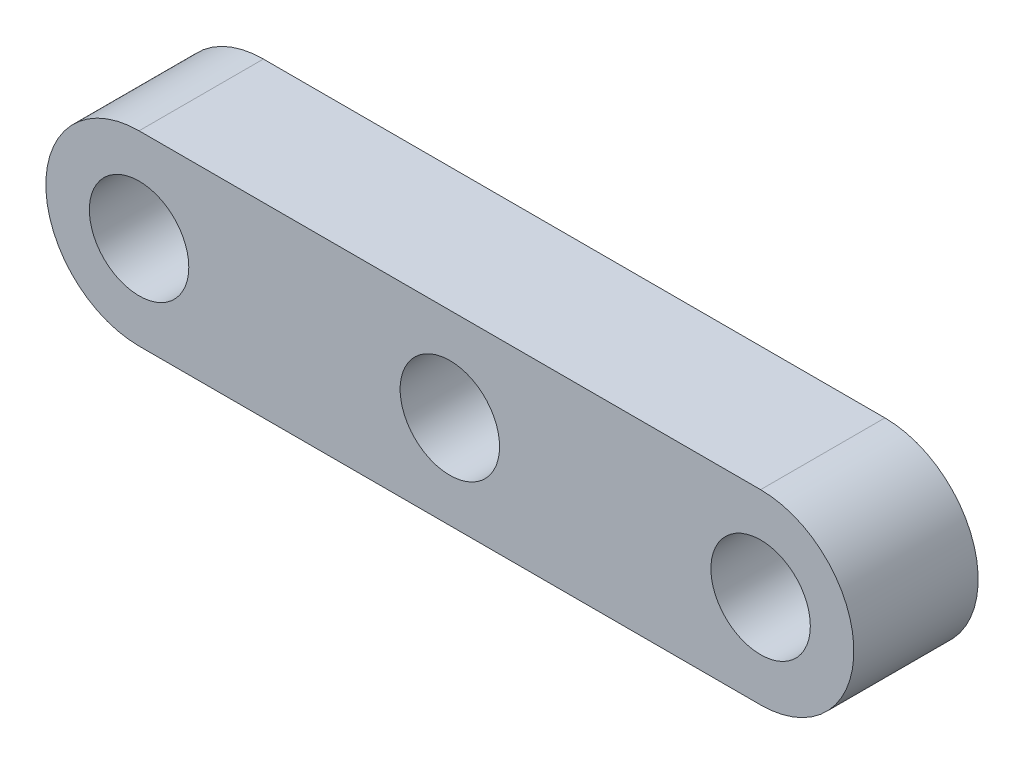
ISO-10303-21;
HEADER;
FILE_DESCRIPTION(('STEP AP214'),'2;1');
FILE_NAME('part.step','',(''),(''),'','','');
FILE_SCHEMA(('AUTOMOTIVE_DESIGN { 1 0 10303 214 1 1 1 1 }'));
ENDSEC;
DATA;
#1=APPLICATION_CONTEXT('core data for automotive mechanical design processes');
#2=APPLICATION_PROTOCOL_DEFINITION('international standard','automotive_design',2000,#1);
#3=PRODUCT_CONTEXT('',#1,'mechanical');
#4=PRODUCT('Part','Part','',(#3));
#5=PRODUCT_RELATED_PRODUCT_CATEGORY('part','',(#4));
#6=PRODUCT_DEFINITION_FORMATION('','',#4);
#7=PRODUCT_DEFINITION_CONTEXT('part definition',#1,'design');
#8=PRODUCT_DEFINITION('design','',#6,#7);
#9=PRODUCT_DEFINITION_SHAPE('','',#8);
#10=(LENGTH_UNIT() NAMED_UNIT(*) SI_UNIT(.MILLI.,.METRE.));
#11=(NAMED_UNIT(*) PLANE_ANGLE_UNIT() SI_UNIT($,.RADIAN.));
#12=(NAMED_UNIT(*) SI_UNIT($,.STERADIAN.) SOLID_ANGLE_UNIT());
#13=UNCERTAINTY_MEASURE_WITH_UNIT(LENGTH_MEASURE(1.E-05),#10,'distance_accuracy_value','');
#14=(GEOMETRIC_REPRESENTATION_CONTEXT(3) GLOBAL_UNCERTAINTY_ASSIGNED_CONTEXT((#13)) GLOBAL_UNIT_ASSIGNED_CONTEXT((#10,
#11,#12)) REPRESENTATION_CONTEXT('',''));
#15=CARTESIAN_POINT('',(0.,0.,0.));
#16=DIRECTION('',(0.,0.,1.));
#17=DIRECTION('',(1.,0.,0.));
#18=AXIS2_PLACEMENT_3D('',#15,#16,#17);
#19=CARTESIAN_POINT('',(0.,0.,2.));
#20=DIRECTION('',(0.,0.,1.));
#21=DIRECTION('',(1.,0.,0.));
#22=AXIS2_PLACEMENT_3D('',#19,#20,#21);
#23=PLANE('',#22);
#24=CARTESIAN_POINT('',(10.,0.,2.));
#25=DIRECTION('',(0.,0.,1.));
#26=DIRECTION('',(1.,0.,0.));
#27=AXIS2_PLACEMENT_3D('',#24,#25,#26);
#28=CIRCLE('',#27,1.6);
#29=CARTESIAN_POINT('',(11.6,0.,2.));
#30=VERTEX_POINT('',#29);
#31=EDGE_CURVE('E123',#30,#30,#28,.T.);
#32=ORIENTED_EDGE('',*,*,#31,.F.);
#33=EDGE_LOOP('',(#32));
#34=FACE_BOUND('',#33,.T.);
#35=CARTESIAN_POINT('',(0.,0.,2.));
#36=DIRECTION('',(0.,0.,1.));
#37=DIRECTION('',(1.,0.,0.));
#38=AXIS2_PLACEMENT_3D('',#35,#36,#37);
#39=CIRCLE('',#38,3.);
#40=CARTESIAN_POINT('',(0.,3.,2.));
#41=VERTEX_POINT('',#40);
#42=CARTESIAN_POINT('',(0.,-3.,2.));
#43=VERTEX_POINT('',#42);
#44=EDGE_CURVE('E93',#41,#43,#39,.T.);
#45=ORIENTED_EDGE('',*,*,#44,.T.);
#46=DIRECTION('',(1.,0.,0.));
#47=VECTOR('',#46,1.);
#48=CARTESIAN_POINT('',(0.,-3.,2.));
#49=LINE('',#48,#47);
#50=CARTESIAN_POINT('',(20.,-3.,2.));
#51=VERTEX_POINT('',#50);
#52=EDGE_CURVE('E88',#43,#51,#49,.T.);
#53=ORIENTED_EDGE('',*,*,#52,.T.);
#54=CARTESIAN_POINT('',(20.,0.,2.));
#55=DIRECTION('',(0.,0.,1.));
#56=DIRECTION('',(1.,0.,0.));
#57=AXIS2_PLACEMENT_3D('',#54,#55,#56);
#58=CIRCLE('',#57,3.);
#59=CARTESIAN_POINT('',(20.,3.,2.));
#60=VERTEX_POINT('',#59);
#61=EDGE_CURVE('E91',#51,#60,#58,.T.);
#62=ORIENTED_EDGE('',*,*,#61,.T.);
#63=DIRECTION('',(-1.,0.,0.));
#64=VECTOR('',#63,1.);
#65=CARTESIAN_POINT('',(0.,3.,2.));
#66=LINE('',#65,#64);
#67=EDGE_CURVE('E58',#60,#41,#66,.T.);
#68=ORIENTED_EDGE('',*,*,#67,.T.);
#69=EDGE_LOOP('',(#45,#53,#62,#68));
#70=FACE_BOUND('',#69,.T.);
#71=CARTESIAN_POINT('',(0.,0.,2.));
#72=DIRECTION('',(0.,0.,1.));
#73=DIRECTION('',(1.,0.,0.));
#74=AXIS2_PLACEMENT_3D('',#71,#72,#73);
#75=CIRCLE('',#74,1.6);
#76=CARTESIAN_POINT('',(1.60000000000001,0.,2.));
#77=VERTEX_POINT('',#76);
#78=EDGE_CURVE('E108',#77,#77,#75,.T.);
#79=ORIENTED_EDGE('',*,*,#78,.F.);
#80=EDGE_LOOP('',(#79));
#81=FACE_BOUND('',#80,.T.);
#82=CARTESIAN_POINT('',(20.,0.,2.));
#83=DIRECTION('',(0.,0.,1.));
#84=DIRECTION('',(1.,0.,0.));
#85=AXIS2_PLACEMENT_3D('',#82,#83,#84);
#86=CIRCLE('',#85,1.6);
#87=CARTESIAN_POINT('',(21.6,0.,2.));
#88=VERTEX_POINT('',#87);
#89=EDGE_CURVE('E129',#88,#88,#86,.T.);
#90=ORIENTED_EDGE('',*,*,#89,.F.);
#91=EDGE_LOOP('',(#90));
#92=FACE_BOUND('',#91,.T.);
#93=ADVANCED_FACE('F41',(#34,#70,#81,#92),#23,.T.);
#94=CARTESIAN_POINT('',(0.,0.,-2.));
#95=DIRECTION('',(0.,0.,1.));
#96=DIRECTION('',(1.,0.,0.));
#97=AXIS2_PLACEMENT_3D('',#94,#95,#96);
#98=PLANE('',#97);
#99=CARTESIAN_POINT('',(0.,0.,-2.));
#100=DIRECTION('',(0.,0.,1.));
#101=DIRECTION('',(1.,0.,0.));
#102=AXIS2_PLACEMENT_3D('',#99,#100,#101);
#103=CIRCLE('',#102,3.);
#104=CARTESIAN_POINT('',(0.,3.,-2.));
#105=VERTEX_POINT('',#104);
#106=CARTESIAN_POINT('',(0.,-3.,-2.));
#107=VERTEX_POINT('',#106);
#108=EDGE_CURVE('E105',#105,#107,#103,.T.);
#109=ORIENTED_EDGE('',*,*,#108,.F.);
#110=DIRECTION('',(-1.,0.,0.));
#111=VECTOR('',#110,1.);
#112=CARTESIAN_POINT('',(0.,3.,-2.));
#113=LINE('',#112,#111);
#114=CARTESIAN_POINT('',(20.,3.,-2.));
#115=VERTEX_POINT('',#114);
#116=EDGE_CURVE('E81',#115,#105,#113,.T.);
#117=ORIENTED_EDGE('',*,*,#116,.F.);
#118=CARTESIAN_POINT('',(20.,0.,-2.));
#119=DIRECTION('',(0.,0.,1.));
#120=DIRECTION('',(1.,0.,0.));
#121=AXIS2_PLACEMENT_3D('',#118,#119,#120);
#122=CIRCLE('',#121,3.);
#123=CARTESIAN_POINT('',(20.,-3.,-2.));
#124=VERTEX_POINT('',#123);
#125=EDGE_CURVE('E75',#124,#115,#122,.T.);
#126=ORIENTED_EDGE('',*,*,#125,.F.);
#127=DIRECTION('',(1.,0.,0.));
#128=VECTOR('',#127,1.);
#129=CARTESIAN_POINT('',(0.,-3.,-2.));
#130=LINE('',#129,#128);
#131=EDGE_CURVE('E97',#107,#124,#130,.T.);
#132=ORIENTED_EDGE('',*,*,#131,.F.);
#133=EDGE_LOOP('',(#109,#117,#126,#132));
#134=FACE_BOUND('',#133,.T.);
#135=CARTESIAN_POINT('',(0.,0.,-2.));
#136=DIRECTION('',(0.,0.,1.));
#137=DIRECTION('',(1.,0.,0.));
#138=AXIS2_PLACEMENT_3D('',#135,#136,#137);
#139=CIRCLE('',#138,1.6);
#140=CARTESIAN_POINT('',(1.60000000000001,0.,-2.));
#141=VERTEX_POINT('',#140);
#142=EDGE_CURVE('E120',#141,#141,#139,.T.);
#143=ORIENTED_EDGE('',*,*,#142,.T.);
#144=EDGE_LOOP('',(#143));
#145=FACE_BOUND('',#144,.T.);
#146=CARTESIAN_POINT('',(10.,0.,-2.));
#147=DIRECTION('',(0.,0.,1.));
#148=DIRECTION('',(1.,0.,0.));
#149=AXIS2_PLACEMENT_3D('',#146,#147,#148);
#150=CIRCLE('',#149,1.6);
#151=CARTESIAN_POINT('',(11.6,0.,-2.));
#152=VERTEX_POINT('',#151);
#153=EDGE_CURVE('E126',#152,#152,#150,.T.);
#154=ORIENTED_EDGE('',*,*,#153,.T.);
#155=EDGE_LOOP('',(#154));
#156=FACE_BOUND('',#155,.T.);
#157=CARTESIAN_POINT('',(20.,0.,-2.));
#158=DIRECTION('',(0.,0.,1.));
#159=DIRECTION('',(1.,0.,0.));
#160=AXIS2_PLACEMENT_3D('',#157,#158,#159);
#161=CIRCLE('',#160,1.6);
#162=CARTESIAN_POINT('',(21.6,0.,-2.));
#163=VERTEX_POINT('',#162);
#164=EDGE_CURVE('E132',#163,#163,#161,.T.);
#165=ORIENTED_EDGE('',*,*,#164,.T.);
#166=EDGE_LOOP('',(#165));
#167=FACE_BOUND('',#166,.T.);
#168=ADVANCED_FACE('F116',(#134,#145,#156,#167),#98,.F.);
#169=CARTESIAN_POINT('',(0.,0.,2.));
#170=DIRECTION('',(0.,0.,-1.));
#171=DIRECTION('',(-1.,0.,0.));
#172=AXIS2_PLACEMENT_3D('',#169,#170,#171);
#173=CYLINDRICAL_SURFACE('',#172,3.);
#174=ORIENTED_EDGE('',*,*,#108,.T.);
#175=DIRECTION('',(0.,0.,-1.));
#176=VECTOR('',#175,1.);
#177=CARTESIAN_POINT('',(0.,-3.,2.));
#178=LINE('',#177,#176);
#179=EDGE_CURVE('E11',#43,#107,#178,.T.);
#180=ORIENTED_EDGE('',*,*,#179,.F.);
#181=ORIENTED_EDGE('',*,*,#44,.F.);
#182=DIRECTION('',(0.,0.,-1.));
#183=VECTOR('',#182,1.);
#184=CARTESIAN_POINT('',(0.,3.,2.));
#185=LINE('',#184,#183);
#186=EDGE_CURVE('E101',#41,#105,#185,.T.);
#187=ORIENTED_EDGE('',*,*,#186,.T.);
#188=EDGE_LOOP('',(#174,#180,#181,#187));
#189=FACE_BOUND('',#188,.T.);
#190=ADVANCED_FACE('F43',(#189),#173,.T.);
#191=CARTESIAN_POINT('',(0.,-3.,2.));
#192=DIRECTION('',(0.,1.,0.));
#193=DIRECTION('',(0.,0.,1.));
#194=AXIS2_PLACEMENT_3D('',#191,#192,#193);
#195=PLANE('',#194);
#196=ORIENTED_EDGE('',*,*,#131,.T.);
#197=DIRECTION('',(0.,0.,-1.));
#198=VECTOR('',#197,1.);
#199=CARTESIAN_POINT('',(20.,-3.,2.));
#200=LINE('',#199,#198);
#201=EDGE_CURVE('E50',#51,#124,#200,.T.);
#202=ORIENTED_EDGE('',*,*,#201,.F.);
#203=ORIENTED_EDGE('',*,*,#52,.F.);
#204=ORIENTED_EDGE('',*,*,#179,.T.);
#205=EDGE_LOOP('',(#196,#202,#203,#204));
#206=FACE_BOUND('',#205,.T.);
#207=ADVANCED_FACE('F96',(#206),#195,.F.);
#208=CARTESIAN_POINT('',(20.,0.,2.));
#209=DIRECTION('',(0.,0.,-1.));
#210=DIRECTION('',(-1.,0.,0.));
#211=AXIS2_PLACEMENT_3D('',#208,#209,#210);
#212=CYLINDRICAL_SURFACE('',#211,3.);
#213=ORIENTED_EDGE('',*,*,#125,.T.);
#214=DIRECTION('',(0.,0.,-1.));
#215=VECTOR('',#214,1.);
#216=CARTESIAN_POINT('',(20.,3.,2.));
#217=LINE('',#216,#215);
#218=EDGE_CURVE('E98',#60,#115,#217,.T.);
#219=ORIENTED_EDGE('',*,*,#218,.F.);
#220=ORIENTED_EDGE('',*,*,#61,.F.);
#221=ORIENTED_EDGE('',*,*,#201,.T.);
#222=EDGE_LOOP('',(#213,#219,#220,#221));
#223=FACE_BOUND('',#222,.T.);
#224=ADVANCED_FACE('F99',(#223),#212,.T.);
#225=CARTESIAN_POINT('',(0.,3.,2.));
#226=DIRECTION('',(0.,-1.,0.));
#227=DIRECTION('',(0.,0.,-1.));
#228=AXIS2_PLACEMENT_3D('',#225,#226,#227);
#229=PLANE('',#228);
#230=ORIENTED_EDGE('',*,*,#116,.T.);
#231=ORIENTED_EDGE('',*,*,#186,.F.);
#232=ORIENTED_EDGE('',*,*,#67,.F.);
#233=ORIENTED_EDGE('',*,*,#218,.T.);
#234=EDGE_LOOP('',(#230,#231,#232,#233));
#235=FACE_BOUND('',#234,.T.);
#236=ADVANCED_FACE('F113',(#235),#229,.F.);
#237=CARTESIAN_POINT('',(0.,0.,2.));
#238=DIRECTION('',(0.,0.,-1.));
#239=DIRECTION('',(-1.,0.,0.));
#240=AXIS2_PLACEMENT_3D('',#237,#238,#239);
#241=CYLINDRICAL_SURFACE('',#240,1.6);
#242=ORIENTED_EDGE('',*,*,#78,.T.);
#243=EDGE_LOOP('',(#242));
#244=FACE_BOUND('',#243,.T.);
#245=ORIENTED_EDGE('',*,*,#142,.F.);
#246=EDGE_LOOP('',(#245));
#247=FACE_BOUND('',#246,.T.);
#248=ADVANCED_FACE('F150',(#244,#247),#241,.F.);
#249=CARTESIAN_POINT('',(10.,0.,2.));
#250=DIRECTION('',(0.,0.,-1.));
#251=DIRECTION('',(-1.,0.,0.));
#252=AXIS2_PLACEMENT_3D('',#249,#250,#251);
#253=CYLINDRICAL_SURFACE('',#252,1.6);
#254=ORIENTED_EDGE('',*,*,#31,.T.);
#255=EDGE_LOOP('',(#254));
#256=FACE_BOUND('',#255,.T.);
#257=ORIENTED_EDGE('',*,*,#153,.F.);
#258=EDGE_LOOP('',(#257));
#259=FACE_BOUND('',#258,.T.);
#260=ADVANCED_FACE('F195',(#256,#259),#253,.F.);
#261=CARTESIAN_POINT('',(20.,0.,2.));
#262=DIRECTION('',(0.,0.,-1.));
#263=DIRECTION('',(-1.,0.,0.));
#264=AXIS2_PLACEMENT_3D('',#261,#262,#263);
#265=CYLINDRICAL_SURFACE('',#264,1.6);
#266=ORIENTED_EDGE('',*,*,#89,.T.);
#267=EDGE_LOOP('',(#266));
#268=FACE_BOUND('',#267,.T.);
#269=ORIENTED_EDGE('',*,*,#164,.F.);
#270=EDGE_LOOP('',(#269));
#271=FACE_BOUND('',#270,.T.);
#272=ADVANCED_FACE('F138',(#268,#271),#265,.F.);
#273=CLOSED_SHELL('',(#93,#168,#190,#207,#224,#236,#248,#260,#272));
#274=MANIFOLD_SOLID_BREP('B2',#273);
#275=ADVANCED_BREP_SHAPE_REPRESENTATION('',(#18,#274),#14);
#276=SHAPE_DEFINITION_REPRESENTATION(#9,#275);
ENDSEC;
END-ISO-10303-21;
